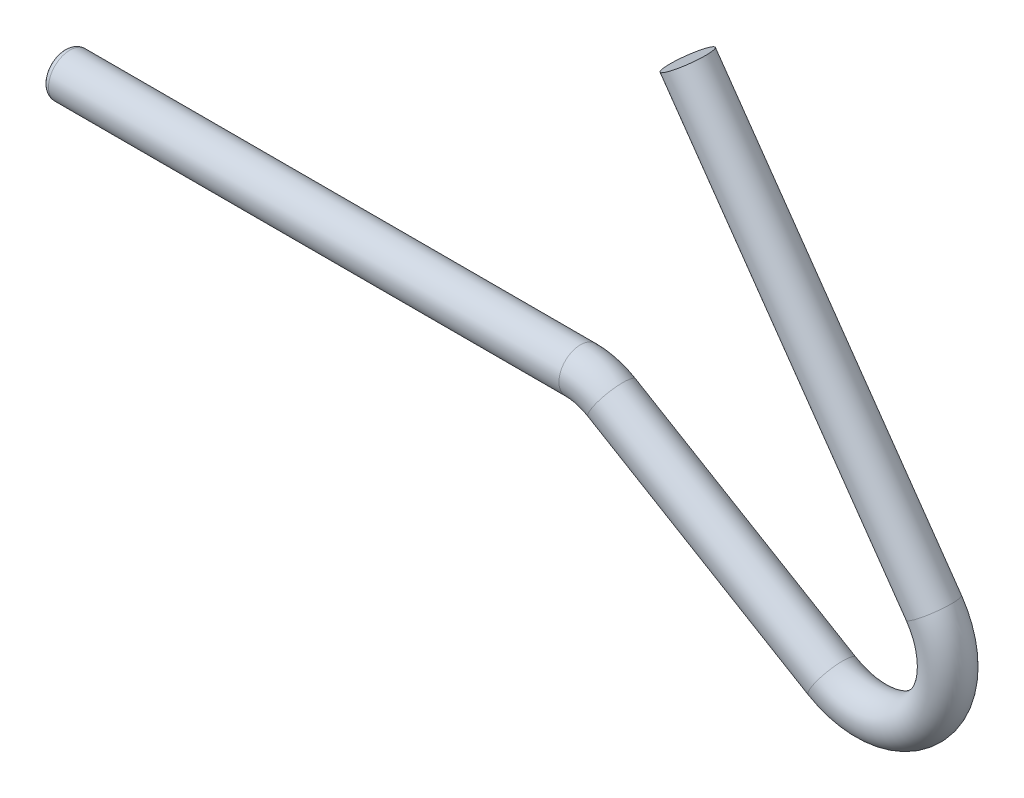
from build123d import *

# Parameters (mm, degrees)
ESQUISSE2_R = 3.5
CONG_1_R    = 1


with BuildPart() as part:
    # Balayage1: sweep along a path in Esquisse1
    with BuildLine(Plane.XY) as balayage1_path:
        Line((0, 0), (84.252442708, 0))
        ThreePointArc((84.252442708, 0), (86.901817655, -0.357344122), (89.36184489, -1.403837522))
        Line((89.36184489, -1.403837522), (125.266993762, -22.745203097))
        ThreePointArc((125.266993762, -22.745203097), (140.815990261, -20.503134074), (141.893147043, -4.830294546))
        Line((141.893147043, -4.830294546), (101.742796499, 52.510348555))
    # Esquisse2 → Balayage1 (sweep)
    with BuildSketch(Plane(origin=(0, 0, 0), x_dir=(0, 0, -1), z_dir=(1, 0, 0))):
        Circle(ESQUISSE2_R)
    sweep(path=balayage1_path.line)

    # Cong_1
    cong_1_edges = [part.edges().sort_by_distance(p)[0] for p in [
        (0, 0, 3.5),
    ]]
    fillet(cong_1_edges, radius=CONG_1_R)


solid = part.part
